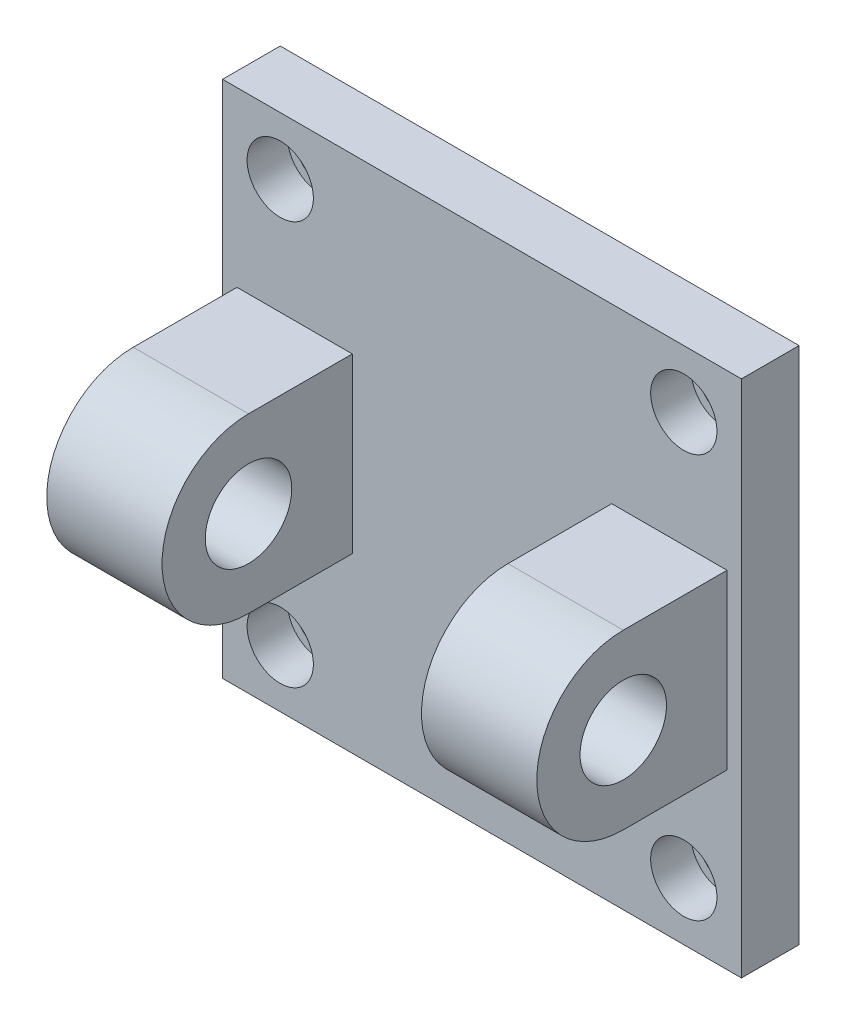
ISO-10303-21;
HEADER;
FILE_DESCRIPTION(('STEP AP214'),'2;1');
FILE_NAME('part.step','',(''),(''),'','','');
FILE_SCHEMA(('AUTOMOTIVE_DESIGN { 1 0 10303 214 1 1 1 1 }'));
ENDSEC;
DATA;
#1=APPLICATION_CONTEXT('core data for automotive mechanical design processes');
#2=APPLICATION_PROTOCOL_DEFINITION('international standard','automotive_design',2000,#1);
#3=PRODUCT_CONTEXT('',#1,'mechanical');
#4=PRODUCT('Part','Part','',(#3));
#5=PRODUCT_RELATED_PRODUCT_CATEGORY('part','',(#4));
#6=PRODUCT_DEFINITION_FORMATION('','',#4);
#7=PRODUCT_DEFINITION_CONTEXT('part definition',#1,'design');
#8=PRODUCT_DEFINITION('design','',#6,#7);
#9=PRODUCT_DEFINITION_SHAPE('','',#8);
#10=(LENGTH_UNIT() NAMED_UNIT(*) SI_UNIT(.MILLI.,.METRE.));
#11=(NAMED_UNIT(*) PLANE_ANGLE_UNIT() SI_UNIT($,.RADIAN.));
#12=(NAMED_UNIT(*) SI_UNIT($,.STERADIAN.) SOLID_ANGLE_UNIT());
#13=UNCERTAINTY_MEASURE_WITH_UNIT(LENGTH_MEASURE(1.E-05),#10,'distance_accuracy_value','');
#14=(GEOMETRIC_REPRESENTATION_CONTEXT(3) GLOBAL_UNCERTAINTY_ASSIGNED_CONTEXT((#13)) GLOBAL_UNIT_ASSIGNED_CONTEXT((#10,
#11,#12)) REPRESENTATION_CONTEXT('',''));
#15=CARTESIAN_POINT('',(0.,0.,0.));
#16=DIRECTION('',(0.,0.,1.));
#17=DIRECTION('',(1.,0.,0.));
#18=AXIS2_PLACEMENT_3D('',#15,#16,#17);
#19=CARTESIAN_POINT('',(70.,-70.,0.));
#20=DIRECTION('',(0.,0.,1.));
#21=DIRECTION('',(1.,0.,0.));
#22=AXIS2_PLACEMENT_3D('',#19,#20,#21);
#23=CYLINDRICAL_SURFACE('',#22,8.50000000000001);
#24=CARTESIAN_POINT('',(70.,-70.,0.));
#25=DIRECTION('',(0.,0.,1.));
#26=DIRECTION('',(1.,0.,0.));
#27=AXIS2_PLACEMENT_3D('',#24,#25,#26);
#28=CIRCLE('',#27,8.50000000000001);
#29=CARTESIAN_POINT('',(78.5,-70.,0.));
#30=VERTEX_POINT('',#29);
#31=EDGE_CURVE('E221',#30,#30,#28,.T.);
#32=ORIENTED_EDGE('',*,*,#31,.F.);
#33=EDGE_LOOP('',(#32));
#34=FACE_BOUND('',#33,.T.);
#35=CARTESIAN_POINT('',(70.,-70.,6.));
#36=DIRECTION('',(0.,0.,1.));
#37=DIRECTION('',(1.,0.,0.));
#38=AXIS2_PLACEMENT_3D('',#35,#36,#37);
#39=CIRCLE('',#38,8.50000000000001);
#40=CARTESIAN_POINT('',(78.5,-70.,6.));
#41=VERTEX_POINT('',#40);
#42=EDGE_CURVE('E41',#41,#41,#39,.F.);
#43=ORIENTED_EDGE('',*,*,#42,.F.);
#44=EDGE_LOOP('',(#43));
#45=FACE_BOUND('',#44,.T.);
#46=ADVANCED_FACE('F37',(#34,#45),#23,.F.);
#47=CARTESIAN_POINT('',(-70.,-70.,0.));
#48=DIRECTION('',(0.,0.,1.));
#49=DIRECTION('',(1.,0.,0.));
#50=AXIS2_PLACEMENT_3D('',#47,#48,#49);
#51=CYLINDRICAL_SURFACE('',#50,8.5);
#52=CARTESIAN_POINT('',(-70.,-70.,0.));
#53=DIRECTION('',(0.,0.,1.));
#54=DIRECTION('',(1.,0.,0.));
#55=AXIS2_PLACEMENT_3D('',#52,#53,#54);
#56=CIRCLE('',#55,8.5);
#57=CARTESIAN_POINT('',(-61.5,-70.,0.));
#58=VERTEX_POINT('',#57);
#59=EDGE_CURVE('E188',#58,#58,#56,.T.);
#60=ORIENTED_EDGE('',*,*,#59,.F.);
#61=EDGE_LOOP('',(#60));
#62=FACE_BOUND('',#61,.T.);
#63=CARTESIAN_POINT('',(-70.,-70.,6.));
#64=DIRECTION('',(0.,0.,1.));
#65=DIRECTION('',(1.,0.,0.));
#66=AXIS2_PLACEMENT_3D('',#63,#64,#65);
#67=CIRCLE('',#66,8.5);
#68=CARTESIAN_POINT('',(-61.5,-70.,6.));
#69=VERTEX_POINT('',#68);
#70=EDGE_CURVE('E194',#69,#69,#67,.F.);
#71=ORIENTED_EDGE('',*,*,#70,.F.);
#72=EDGE_LOOP('',(#71));
#73=FACE_BOUND('',#72,.T.);
#74=ADVANCED_FACE('F304',(#62,#73),#51,.F.);
#75=CARTESIAN_POINT('',(70.,70.,0.));
#76=DIRECTION('',(0.,0.,1.));
#77=DIRECTION('',(1.,0.,0.));
#78=AXIS2_PLACEMENT_3D('',#75,#76,#77);
#79=CYLINDRICAL_SURFACE('',#78,8.49999999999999);
#80=CARTESIAN_POINT('',(70.,70.,0.));
#81=DIRECTION('',(0.,0.,1.));
#82=DIRECTION('',(1.,0.,0.));
#83=AXIS2_PLACEMENT_3D('',#80,#81,#82);
#84=CIRCLE('',#83,8.49999999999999);
#85=CARTESIAN_POINT('',(78.5,70.,0.));
#86=VERTEX_POINT('',#85);
#87=EDGE_CURVE('E224',#86,#86,#84,.T.);
#88=ORIENTED_EDGE('',*,*,#87,.F.);
#89=EDGE_LOOP('',(#88));
#90=FACE_BOUND('',#89,.T.);
#91=CARTESIAN_POINT('',(70.,70.,6.));
#92=DIRECTION('',(0.,0.,1.));
#93=DIRECTION('',(1.,0.,0.));
#94=AXIS2_PLACEMENT_3D('',#91,#92,#93);
#95=CIRCLE('',#94,8.49999999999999);
#96=CARTESIAN_POINT('',(78.5,70.,6.));
#97=VERTEX_POINT('',#96);
#98=EDGE_CURVE('E190',#97,#97,#95,.F.);
#99=ORIENTED_EDGE('',*,*,#98,.F.);
#100=EDGE_LOOP('',(#99));
#101=FACE_BOUND('',#100,.T.);
#102=ADVANCED_FACE('F310',(#90,#101),#79,.F.);
#103=CARTESIAN_POINT('',(-70.,70.,0.));
#104=DIRECTION('',(0.,0.,1.));
#105=DIRECTION('',(1.,0.,0.));
#106=AXIS2_PLACEMENT_3D('',#103,#104,#105);
#107=CYLINDRICAL_SURFACE('',#106,8.5);
#108=CARTESIAN_POINT('',(-70.,70.,0.));
#109=DIRECTION('',(0.,0.,1.));
#110=DIRECTION('',(1.,0.,0.));
#111=AXIS2_PLACEMENT_3D('',#108,#109,#110);
#112=CIRCLE('',#111,8.5);
#113=CARTESIAN_POINT('',(-61.5,70.,0.));
#114=VERTEX_POINT('',#113);
#115=EDGE_CURVE('E227',#114,#114,#112,.T.);
#116=ORIENTED_EDGE('',*,*,#115,.F.);
#117=EDGE_LOOP('',(#116));
#118=FACE_BOUND('',#117,.T.);
#119=CARTESIAN_POINT('',(-70.,70.,6.));
#120=DIRECTION('',(0.,0.,1.));
#121=DIRECTION('',(1.,0.,0.));
#122=AXIS2_PLACEMENT_3D('',#119,#120,#121);
#123=CIRCLE('',#122,8.5);
#124=CARTESIAN_POINT('',(-61.5,70.,6.));
#125=VERTEX_POINT('',#124);
#126=EDGE_CURVE('E185',#125,#125,#123,.F.);
#127=ORIENTED_EDGE('',*,*,#126,.F.);
#128=EDGE_LOOP('',(#127));
#129=FACE_BOUND('',#128,.T.);
#130=ADVANCED_FACE('F319',(#118,#129),#107,.F.);
#131=CARTESIAN_POINT('',(90.,30.,20.));
#132=DIRECTION('',(0.,1.,0.));
#133=DIRECTION('',(-1.,0.,0.));
#134=AXIS2_PLACEMENT_3D('',#131,#132,#133);
#135=PLANE('',#134);
#136=DIRECTION('',(-1.,0.,0.));
#137=VECTOR('',#136,1.);
#138=CARTESIAN_POINT('',(90.,30.,56.));
#139=LINE('',#138,#137);
#140=CARTESIAN_POINT('',(-45.,30.,56.));
#141=VERTEX_POINT('',#140);
#142=CARTESIAN_POINT('',(-85.,30.,56.));
#143=VERTEX_POINT('',#142);
#144=EDGE_CURVE('E269',#141,#143,#139,.T.);
#145=ORIENTED_EDGE('',*,*,#144,.F.);
#146=DIRECTION('',(0.,0.,-1.));
#147=VECTOR('',#146,1.);
#148=CARTESIAN_POINT('',(-45.,30.,20.));
#149=LINE('',#148,#147);
#150=CARTESIAN_POINT('',(-45.,30.,20.));
#151=VERTEX_POINT('',#150);
#152=EDGE_CURVE('E246',#141,#151,#149,.T.);
#153=ORIENTED_EDGE('',*,*,#152,.T.);
#154=DIRECTION('',(-1.,0.,0.));
#155=VECTOR('',#154,1.);
#156=CARTESIAN_POINT('',(90.,30.,20.));
#157=LINE('',#156,#155);
#158=CARTESIAN_POINT('',(-85.,30.,20.));
#159=VERTEX_POINT('',#158);
#160=EDGE_CURVE('E179',#151,#159,#157,.T.);
#161=ORIENTED_EDGE('',*,*,#160,.T.);
#162=DIRECTION('',(0.,0.,1.));
#163=VECTOR('',#162,1.);
#164=CARTESIAN_POINT('',(-85.,30.,20.));
#165=LINE('',#164,#163);
#166=EDGE_CURVE('E164',#159,#143,#165,.T.);
#167=ORIENTED_EDGE('',*,*,#166,.T.);
#168=EDGE_LOOP('',(#145,#153,#161,#167));
#169=FACE_BOUND('',#168,.T.);
#170=ADVANCED_FACE('F283',(#169),#135,.T.);
#171=CARTESIAN_POINT('',(85.,30.,20.));
#172=VERTEX_POINT('',#171);
#173=CARTESIAN_POINT('',(45.,30.,20.));
#174=VERTEX_POINT('',#173);
#175=EDGE_CURVE('E169',#172,#174,#157,.T.);
#176=ORIENTED_EDGE('',*,*,#175,.T.);
#177=DIRECTION('',(0.,0.,1.));
#178=VECTOR('',#177,1.);
#179=CARTESIAN_POINT('',(45.,30.,20.));
#180=LINE('',#179,#178);
#181=CARTESIAN_POINT('',(45.,30.,56.));
#182=VERTEX_POINT('',#181);
#183=EDGE_CURVE('E141',#174,#182,#180,.T.);
#184=ORIENTED_EDGE('',*,*,#183,.T.);
#185=CARTESIAN_POINT('',(85.,30.,56.));
#186=VERTEX_POINT('',#185);
#187=EDGE_CURVE('E266',#186,#182,#139,.T.);
#188=ORIENTED_EDGE('',*,*,#187,.F.);
#189=DIRECTION('',(0.,0.,-1.));
#190=VECTOR('',#189,1.);
#191=CARTESIAN_POINT('',(85.,30.,20.));
#192=LINE('',#191,#190);
#193=EDGE_CURVE('E255',#186,#172,#192,.T.);
#194=ORIENTED_EDGE('',*,*,#193,.T.);
#195=EDGE_LOOP('',(#176,#184,#188,#194));
#196=FACE_BOUND('',#195,.T.);
#197=ADVANCED_FACE('F338',(#196),#135,.T.);
#198=CARTESIAN_POINT('',(90.,0.,56.));
#199=DIRECTION('',(-1.,0.,0.));
#200=DIRECTION('',(0.,-1.,0.));
#201=AXIS2_PLACEMENT_3D('',#198,#199,#200);
#202=CYLINDRICAL_SURFACE('',#201,30.);
#203=DIRECTION('',(-1.,0.,0.));
#204=VECTOR('',#203,1.);
#205=CARTESIAN_POINT('',(90.,-30.,56.));
#206=LINE('',#205,#204);
#207=CARTESIAN_POINT('',(-45.,-30.,56.));
#208=VERTEX_POINT('',#207);
#209=CARTESIAN_POINT('',(-85.,-30.,56.));
#210=VERTEX_POINT('',#209);
#211=EDGE_CURVE('E160',#208,#210,#206,.T.);
#212=ORIENTED_EDGE('',*,*,#211,.F.);
#213=CARTESIAN_POINT('',(-45.,0.,56.));
#214=DIRECTION('',(1.,0.,0.));
#215=DIRECTION('',(0.,1.,0.));
#216=AXIS2_PLACEMENT_3D('',#213,#214,#215);
#217=CIRCLE('',#216,30.);
#218=EDGE_CURVE('E243',#208,#141,#217,.F.);
#219=ORIENTED_EDGE('',*,*,#218,.T.);
#220=ORIENTED_EDGE('',*,*,#144,.T.);
#221=CARTESIAN_POINT('',(-85.,0.,56.));
#222=DIRECTION('',(-1.,0.,0.));
#223=DIRECTION('',(0.,-1.,0.));
#224=AXIS2_PLACEMENT_3D('',#221,#222,#223);
#225=CIRCLE('',#224,30.);
#226=EDGE_CURVE('E261',#143,#210,#225,.F.);
#227=ORIENTED_EDGE('',*,*,#226,.T.);
#228=EDGE_LOOP('',(#212,#219,#220,#227));
#229=FACE_BOUND('',#228,.T.);
#230=ADVANCED_FACE('F276',(#229),#202,.T.);
#231=ORIENTED_EDGE('',*,*,#187,.T.);
#232=CARTESIAN_POINT('',(45.,0.,56.));
#233=DIRECTION('',(-1.,0.,0.));
#234=DIRECTION('',(0.,-1.,0.));
#235=AXIS2_PLACEMENT_3D('',#232,#233,#234);
#236=CIRCLE('',#235,30.);
#237=CARTESIAN_POINT('',(45.,-30.,56.));
#238=VERTEX_POINT('',#237);
#239=EDGE_CURVE('E155',#182,#238,#236,.F.);
#240=ORIENTED_EDGE('',*,*,#239,.T.);
#241=CARTESIAN_POINT('',(85.,-30.,56.));
#242=VERTEX_POINT('',#241);
#243=EDGE_CURVE('E154',#242,#238,#206,.T.);
#244=ORIENTED_EDGE('',*,*,#243,.F.);
#245=CARTESIAN_POINT('',(85.,0.,56.));
#246=DIRECTION('',(1.,0.,0.));
#247=DIRECTION('',(0.,1.,0.));
#248=AXIS2_PLACEMENT_3D('',#245,#246,#247);
#249=CIRCLE('',#248,30.);
#250=EDGE_CURVE('E252',#242,#186,#249,.F.);
#251=ORIENTED_EDGE('',*,*,#250,.T.);
#252=EDGE_LOOP('',(#231,#240,#244,#251));
#253=FACE_BOUND('',#252,.T.);
#254=ADVANCED_FACE('F336',(#253),#202,.T.);
#255=CARTESIAN_POINT('',(90.,-30.,56.));
#256=DIRECTION('',(0.,-1.,0.));
#257=DIRECTION('',(1.,0.,0.));
#258=AXIS2_PLACEMENT_3D('',#255,#256,#257);
#259=PLANE('',#258);
#260=DIRECTION('',(-1.,0.,0.));
#261=VECTOR('',#260,1.);
#262=CARTESIAN_POINT('',(90.,-30.,20.));
#263=LINE('',#262,#261);
#264=CARTESIAN_POINT('',(-45.,-30.,20.));
#265=VERTEX_POINT('',#264);
#266=CARTESIAN_POINT('',(-85.,-30.,20.));
#267=VERTEX_POINT('',#266);
#268=EDGE_CURVE('E161',#265,#267,#263,.T.);
#269=ORIENTED_EDGE('',*,*,#268,.F.);
#270=DIRECTION('',(0.,0.,1.));
#271=VECTOR('',#270,1.);
#272=CARTESIAN_POINT('',(-45.,-30.,56.));
#273=LINE('',#272,#271);
#274=EDGE_CURVE('E240',#265,#208,#273,.T.);
#275=ORIENTED_EDGE('',*,*,#274,.T.);
#276=ORIENTED_EDGE('',*,*,#211,.T.);
#277=DIRECTION('',(0.,0.,-1.));
#278=VECTOR('',#277,1.);
#279=CARTESIAN_POINT('',(-85.,-30.,56.));
#280=LINE('',#279,#278);
#281=EDGE_CURVE('E11',#210,#267,#280,.T.);
#282=ORIENTED_EDGE('',*,*,#281,.T.);
#283=EDGE_LOOP('',(#269,#275,#276,#282));
#284=FACE_BOUND('',#283,.T.);
#285=ADVANCED_FACE('F286',(#284),#259,.T.);
#286=ORIENTED_EDGE('',*,*,#243,.T.);
#287=DIRECTION('',(0.,0.,-1.));
#288=VECTOR('',#287,1.);
#289=CARTESIAN_POINT('',(45.,-30.,56.));
#290=LINE('',#289,#288);
#291=CARTESIAN_POINT('',(45.,-30.,20.));
#292=VERTEX_POINT('',#291);
#293=EDGE_CURVE('E138',#238,#292,#290,.T.);
#294=ORIENTED_EDGE('',*,*,#293,.T.);
#295=CARTESIAN_POINT('',(85.,-30.,20.));
#296=VERTEX_POINT('',#295);
#297=EDGE_CURVE('E152',#296,#292,#263,.T.);
#298=ORIENTED_EDGE('',*,*,#297,.F.);
#299=DIRECTION('',(0.,0.,1.));
#300=VECTOR('',#299,1.);
#301=CARTESIAN_POINT('',(85.,-30.,56.));
#302=LINE('',#301,#300);
#303=EDGE_CURVE('E250',#296,#242,#302,.T.);
#304=ORIENTED_EDGE('',*,*,#303,.T.);
#305=EDGE_LOOP('',(#286,#294,#298,#304));
#306=FACE_BOUND('',#305,.T.);
#307=ADVANCED_FACE('F150',(#306),#259,.T.);
#308=CARTESIAN_POINT('',(-90.,90.,20.));
#309=DIRECTION('',(1.,0.,0.));
#310=DIRECTION('',(0.,1.,0.));
#311=AXIS2_PLACEMENT_3D('',#308,#309,#310);
#312=PLANE('',#311);
#313=DIRECTION('',(0.,0.,-1.));
#314=VECTOR('',#313,1.);
#315=CARTESIAN_POINT('',(-90.,-90.,20.));
#316=LINE('',#315,#314);
#317=CARTESIAN_POINT('',(-90.,-90.,20.));
#318=VERTEX_POINT('',#317);
#319=CARTESIAN_POINT('',(-90.,-90.,0.));
#320=VERTEX_POINT('',#319);
#321=EDGE_CURVE('E46',#318,#320,#316,.T.);
#322=ORIENTED_EDGE('',*,*,#321,.F.);
#323=DIRECTION('',(0.,-1.,0.));
#324=VECTOR('',#323,1.);
#325=CARTESIAN_POINT('',(-90.,90.,20.));
#326=LINE('',#325,#324);
#327=CARTESIAN_POINT('',(-90.,90.,20.));
#328=VERTEX_POINT('',#327);
#329=EDGE_CURVE('E89',#328,#318,#326,.T.);
#330=ORIENTED_EDGE('',*,*,#329,.F.);
#331=DIRECTION('',(0.,0.,-1.));
#332=VECTOR('',#331,1.);
#333=CARTESIAN_POINT('',(-90.,90.,20.));
#334=LINE('',#333,#332);
#335=CARTESIAN_POINT('',(-90.,90.,0.));
#336=VERTEX_POINT('',#335);
#337=EDGE_CURVE('E353',#328,#336,#334,.T.);
#338=ORIENTED_EDGE('',*,*,#337,.T.);
#339=DIRECTION('',(0.,-1.,0.));
#340=VECTOR('',#339,1.);
#341=CARTESIAN_POINT('',(-90.,90.,0.));
#342=LINE('',#341,#340);
#343=EDGE_CURVE('E339',#336,#320,#342,.T.);
#344=ORIENTED_EDGE('',*,*,#343,.T.);
#345=EDGE_LOOP('',(#322,#330,#338,#344));
#346=FACE_BOUND('',#345,.T.);
#347=ADVANCED_FACE('F39',(#346),#312,.F.);
#348=CARTESIAN_POINT('',(90.,-90.,20.));
#349=DIRECTION('',(0.,1.,0.));
#350=DIRECTION('',(-1.,0.,0.));
#351=AXIS2_PLACEMENT_3D('',#348,#349,#350);
#352=PLANE('',#351);
#353=DIRECTION('',(1.,0.,0.));
#354=VECTOR('',#353,1.);
#355=CARTESIAN_POINT('',(90.,-90.,0.));
#356=LINE('',#355,#354);
#357=CARTESIAN_POINT('',(90.,-90.,0.));
#358=VERTEX_POINT('',#357);
#359=EDGE_CURVE('E341',#320,#358,#356,.T.);
#360=ORIENTED_EDGE('',*,*,#359,.T.);
#361=DIRECTION('',(0.,0.,-1.));
#362=VECTOR('',#361,1.);
#363=CARTESIAN_POINT('',(90.,-90.,20.));
#364=LINE('',#363,#362);
#365=CARTESIAN_POINT('',(90.,-90.,20.));
#366=VERTEX_POINT('',#365);
#367=EDGE_CURVE('E357',#366,#358,#364,.T.);
#368=ORIENTED_EDGE('',*,*,#367,.F.);
#369=DIRECTION('',(1.,0.,0.));
#370=VECTOR('',#369,1.);
#371=CARTESIAN_POINT('',(90.,-90.,20.));
#372=LINE('',#371,#370);
#373=EDGE_CURVE('E362',#318,#366,#372,.T.);
#374=ORIENTED_EDGE('',*,*,#373,.F.);
#375=ORIENTED_EDGE('',*,*,#321,.T.);
#376=EDGE_LOOP('',(#360,#368,#374,#375));
#377=FACE_BOUND('',#376,.T.);
#378=ADVANCED_FACE('F369',(#377),#352,.F.);
#379=CARTESIAN_POINT('',(90.,90.,20.));
#380=DIRECTION('',(-1.,0.,0.));
#381=DIRECTION('',(0.,-1.,0.));
#382=AXIS2_PLACEMENT_3D('',#379,#380,#381);
#383=PLANE('',#382);
#384=DIRECTION('',(0.,0.,-1.));
#385=VECTOR('',#384,1.);
#386=CARTESIAN_POINT('',(90.,90.,20.));
#387=LINE('',#386,#385);
#388=CARTESIAN_POINT('',(90.,90.,20.));
#389=VERTEX_POINT('',#388);
#390=CARTESIAN_POINT('',(90.,90.,0.));
#391=VERTEX_POINT('',#390);
#392=EDGE_CURVE('E355',#389,#391,#387,.T.);
#393=ORIENTED_EDGE('',*,*,#392,.F.);
#394=DIRECTION('',(0.,1.,0.));
#395=VECTOR('',#394,1.);
#396=CARTESIAN_POINT('',(90.,90.,20.));
#397=LINE('',#396,#395);
#398=EDGE_CURVE('E363',#366,#389,#397,.T.);
#399=ORIENTED_EDGE('',*,*,#398,.F.);
#400=ORIENTED_EDGE('',*,*,#367,.T.);
#401=DIRECTION('',(0.,1.,0.));
#402=VECTOR('',#401,1.);
#403=CARTESIAN_POINT('',(90.,90.,0.));
#404=LINE('',#403,#402);
#405=EDGE_CURVE('E346',#358,#391,#404,.T.);
#406=ORIENTED_EDGE('',*,*,#405,.T.);
#407=EDGE_LOOP('',(#393,#399,#400,#406));
#408=FACE_BOUND('',#407,.T.);
#409=ADVANCED_FACE('F372',(#408),#383,.F.);
#410=CARTESIAN_POINT('',(90.,90.,20.));
#411=DIRECTION('',(0.,-1.,0.));
#412=DIRECTION('',(1.,0.,0.));
#413=AXIS2_PLACEMENT_3D('',#410,#411,#412);
#414=PLANE('',#413);
#415=DIRECTION('',(-1.,0.,0.));
#416=VECTOR('',#415,1.);
#417=CARTESIAN_POINT('',(90.,90.,0.));
#418=LINE('',#417,#416);
#419=EDGE_CURVE('E84',#391,#336,#418,.T.);
#420=ORIENTED_EDGE('',*,*,#419,.T.);
#421=ORIENTED_EDGE('',*,*,#337,.F.);
#422=DIRECTION('',(-1.,0.,0.));
#423=VECTOR('',#422,1.);
#424=CARTESIAN_POINT('',(90.,90.,20.));
#425=LINE('',#424,#423);
#426=EDGE_CURVE('E63',#389,#328,#425,.T.);
#427=ORIENTED_EDGE('',*,*,#426,.F.);
#428=ORIENTED_EDGE('',*,*,#392,.T.);
#429=EDGE_LOOP('',(#420,#421,#427,#428));
#430=FACE_BOUND('',#429,.T.);
#431=ADVANCED_FACE('F373',(#430),#414,.F.);
#432=CARTESIAN_POINT('',(0.,0.,20.));
#433=DIRECTION('',(0.,0.,-1.));
#434=DIRECTION('',(-1.,0.,0.));
#435=AXIS2_PLACEMENT_3D('',#432,#433,#434);
#436=PLANE('',#435);
#437=CARTESIAN_POINT('',(70.,-70.,20.));
#438=DIRECTION('',(0.,0.,1.));
#439=DIRECTION('',(1.,0.,0.));
#440=AXIS2_PLACEMENT_3D('',#437,#438,#439);
#441=CIRCLE('',#440,11.5);
#442=CARTESIAN_POINT('',(81.5,-70.,20.));
#443=VERTEX_POINT('',#442);
#444=EDGE_CURVE('E210',#443,#443,#441,.T.);
#445=ORIENTED_EDGE('',*,*,#444,.F.);
#446=EDGE_LOOP('',(#445));
#447=FACE_BOUND('',#446,.T.);
#448=CARTESIAN_POINT('',(-70.,-70.,20.));
#449=DIRECTION('',(0.,0.,1.));
#450=DIRECTION('',(1.,0.,0.));
#451=AXIS2_PLACEMENT_3D('',#448,#449,#450);
#452=CIRCLE('',#451,11.5);
#453=CARTESIAN_POINT('',(-58.5,-70.,20.));
#454=VERTEX_POINT('',#453);
#455=EDGE_CURVE('E203',#454,#454,#452,.T.);
#456=ORIENTED_EDGE('',*,*,#455,.F.);
#457=EDGE_LOOP('',(#456));
#458=FACE_BOUND('',#457,.T.);
#459=CARTESIAN_POINT('',(70.,70.,20.));
#460=DIRECTION('',(0.,0.,1.));
#461=DIRECTION('',(1.,0.,0.));
#462=AXIS2_PLACEMENT_3D('',#459,#460,#461);
#463=CIRCLE('',#462,11.5);
#464=CARTESIAN_POINT('',(81.5,70.,20.));
#465=VERTEX_POINT('',#464);
#466=EDGE_CURVE('E196',#465,#465,#463,.T.);
#467=ORIENTED_EDGE('',*,*,#466,.F.);
#468=EDGE_LOOP('',(#467));
#469=FACE_BOUND('',#468,.T.);
#470=CARTESIAN_POINT('',(-70.,70.,20.));
#471=DIRECTION('',(0.,0.,1.));
#472=DIRECTION('',(1.,0.,0.));
#473=AXIS2_PLACEMENT_3D('',#470,#471,#472);
#474=CIRCLE('',#473,11.5);
#475=CARTESIAN_POINT('',(-58.5,70.,20.));
#476=VERTEX_POINT('',#475);
#477=EDGE_CURVE('E192',#476,#476,#474,.T.);
#478=ORIENTED_EDGE('',*,*,#477,.F.);
#479=EDGE_LOOP('',(#478));
#480=FACE_BOUND('',#479,.T.);
#481=ORIENTED_EDGE('',*,*,#160,.F.);
#482=DIRECTION('',(0.,-1.,0.));
#483=VECTOR('',#482,1.);
#484=CARTESIAN_POINT('',(-45.,90.,20.));
#485=LINE('',#484,#483);
#486=EDGE_CURVE('E54',#151,#265,#485,.T.);
#487=ORIENTED_EDGE('',*,*,#486,.T.);
#488=ORIENTED_EDGE('',*,*,#268,.T.);
#489=DIRECTION('',(0.,1.,0.));
#490=VECTOR('',#489,1.);
#491=CARTESIAN_POINT('',(-85.,90.,20.));
#492=LINE('',#491,#490);
#493=EDGE_CURVE('E258',#267,#159,#492,.T.);
#494=ORIENTED_EDGE('',*,*,#493,.T.);
#495=EDGE_LOOP('',(#481,#487,#488,#494));
#496=FACE_BOUND('',#495,.T.);
#497=DIRECTION('',(0.,1.,0.));
#498=VECTOR('',#497,1.);
#499=CARTESIAN_POINT('',(45.,90.,20.));
#500=LINE('',#499,#498);
#501=EDGE_CURVE('E135',#292,#174,#500,.T.);
#502=ORIENTED_EDGE('',*,*,#501,.T.);
#503=ORIENTED_EDGE('',*,*,#175,.F.);
#504=DIRECTION('',(0.,-1.,0.));
#505=VECTOR('',#504,1.);
#506=CARTESIAN_POINT('',(85.,90.,20.));
#507=LINE('',#506,#505);
#508=EDGE_CURVE('E159',#172,#296,#507,.T.);
#509=ORIENTED_EDGE('',*,*,#508,.T.);
#510=ORIENTED_EDGE('',*,*,#297,.T.);
#511=EDGE_LOOP('',(#502,#503,#509,#510));
#512=FACE_BOUND('',#511,.T.);
#513=ORIENTED_EDGE('',*,*,#426,.T.);
#514=ORIENTED_EDGE('',*,*,#329,.T.);
#515=ORIENTED_EDGE('',*,*,#373,.T.);
#516=ORIENTED_EDGE('',*,*,#398,.T.);
#517=EDGE_LOOP('',(#513,#514,#515,#516));
#518=FACE_BOUND('',#517,.T.);
#519=ADVANCED_FACE('F158',(#447,#458,#469,#480,#496,#512,#518),#436,.F.);
#520=CARTESIAN_POINT('',(0.,0.,0.));
#521=DIRECTION('',(0.,0.,-1.));
#522=DIRECTION('',(-1.,0.,0.));
#523=AXIS2_PLACEMENT_3D('',#520,#521,#522);
#524=PLANE('',#523);
#525=ORIENTED_EDGE('',*,*,#59,.T.);
#526=EDGE_LOOP('',(#525));
#527=FACE_BOUND('',#526,.T.);
#528=ORIENTED_EDGE('',*,*,#31,.T.);
#529=EDGE_LOOP('',(#528));
#530=FACE_BOUND('',#529,.T.);
#531=ORIENTED_EDGE('',*,*,#87,.T.);
#532=EDGE_LOOP('',(#531));
#533=FACE_BOUND('',#532,.T.);
#534=ORIENTED_EDGE('',*,*,#115,.T.);
#535=EDGE_LOOP('',(#534));
#536=FACE_BOUND('',#535,.T.);
#537=ORIENTED_EDGE('',*,*,#343,.F.);
#538=ORIENTED_EDGE('',*,*,#419,.F.);
#539=ORIENTED_EDGE('',*,*,#405,.F.);
#540=ORIENTED_EDGE('',*,*,#359,.F.);
#541=EDGE_LOOP('',(#537,#538,#539,#540));
#542=FACE_BOUND('',#541,.T.);
#543=ADVANCED_FACE('F388',(#527,#530,#533,#536,#542),#524,.T.);
#544=CARTESIAN_POINT('',(-85.,90.,90.));
#545=DIRECTION('',(-1.,0.,0.));
#546=DIRECTION('',(0.,-1.,0.));
#547=AXIS2_PLACEMENT_3D('',#544,#545,#546);
#548=PLANE('',#547);
#549=CARTESIAN_POINT('',(-85.,0.,56.));
#550=DIRECTION('',(-1.,0.,0.));
#551=DIRECTION('',(0.,-1.,0.));
#552=AXIS2_PLACEMENT_3D('',#549,#550,#551);
#553=CIRCLE('',#552,15.);
#554=CARTESIAN_POINT('',(-85.,-15.,56.));
#555=VERTEX_POINT('',#554);
#556=EDGE_CURVE('E184',#555,#555,#553,.T.);
#557=ORIENTED_EDGE('',*,*,#556,.F.);
#558=EDGE_LOOP('',(#557));
#559=FACE_BOUND('',#558,.T.);
#560=ORIENTED_EDGE('',*,*,#493,.F.);
#561=ORIENTED_EDGE('',*,*,#281,.F.);
#562=ORIENTED_EDGE('',*,*,#226,.F.);
#563=ORIENTED_EDGE('',*,*,#166,.F.);
#564=EDGE_LOOP('',(#560,#561,#562,#563));
#565=FACE_BOUND('',#564,.T.);
#566=ADVANCED_FACE('F282',(#559,#565),#548,.T.);
#567=CARTESIAN_POINT('',(85.,90.,90.));
#568=DIRECTION('',(1.,0.,0.));
#569=DIRECTION('',(0.,1.,0.));
#570=AXIS2_PLACEMENT_3D('',#567,#568,#569);
#571=PLANE('',#570);
#572=CARTESIAN_POINT('',(85.,0.,56.));
#573=DIRECTION('',(1.,0.,0.));
#574=DIRECTION('',(0.,1.,0.));
#575=AXIS2_PLACEMENT_3D('',#572,#573,#574);
#576=CIRCLE('',#575,15.);
#577=CARTESIAN_POINT('',(85.,15.,56.));
#578=VERTEX_POINT('',#577);
#579=EDGE_CURVE('E234',#578,#578,#576,.T.);
#580=ORIENTED_EDGE('',*,*,#579,.F.);
#581=EDGE_LOOP('',(#580));
#582=FACE_BOUND('',#581,.T.);
#583=ORIENTED_EDGE('',*,*,#250,.F.);
#584=ORIENTED_EDGE('',*,*,#303,.F.);
#585=ORIENTED_EDGE('',*,*,#508,.F.);
#586=ORIENTED_EDGE('',*,*,#193,.F.);
#587=EDGE_LOOP('',(#583,#584,#585,#586));
#588=FACE_BOUND('',#587,.T.);
#589=ADVANCED_FACE('F290',(#582,#588),#571,.T.);
#590=CARTESIAN_POINT('',(-45.,90.,90.));
#591=DIRECTION('',(1.,0.,0.));
#592=DIRECTION('',(0.,1.,0.));
#593=AXIS2_PLACEMENT_3D('',#590,#591,#592);
#594=PLANE('',#593);
#595=CARTESIAN_POINT('',(-45.,0.,56.));
#596=DIRECTION('',(1.,0.,0.));
#597=DIRECTION('',(0.,1.,0.));
#598=AXIS2_PLACEMENT_3D('',#595,#596,#597);
#599=CIRCLE('',#598,15.);
#600=CARTESIAN_POINT('',(-45.,15.,56.));
#601=VERTEX_POINT('',#600);
#602=EDGE_CURVE('E183',#601,#601,#599,.T.);
#603=ORIENTED_EDGE('',*,*,#602,.F.);
#604=EDGE_LOOP('',(#603));
#605=FACE_BOUND('',#604,.T.);
#606=ORIENTED_EDGE('',*,*,#218,.F.);
#607=ORIENTED_EDGE('',*,*,#274,.F.);
#608=ORIENTED_EDGE('',*,*,#486,.F.);
#609=ORIENTED_EDGE('',*,*,#152,.F.);
#610=EDGE_LOOP('',(#606,#607,#608,#609));
#611=FACE_BOUND('',#610,.T.);
#612=ADVANCED_FACE('F288',(#605,#611),#594,.T.);
#613=CARTESIAN_POINT('',(45.,90.,90.));
#614=DIRECTION('',(-1.,0.,0.));
#615=DIRECTION('',(0.,-1.,0.));
#616=AXIS2_PLACEMENT_3D('',#613,#614,#615);
#617=PLANE('',#616);
#618=CARTESIAN_POINT('',(45.,0.,56.));
#619=DIRECTION('',(-1.,0.,0.));
#620=DIRECTION('',(0.,-1.,0.));
#621=AXIS2_PLACEMENT_3D('',#618,#619,#620);
#622=CIRCLE('',#621,15.);
#623=CARTESIAN_POINT('',(45.,-15.,56.));
#624=VERTEX_POINT('',#623);
#625=EDGE_CURVE('E180',#624,#624,#622,.T.);
#626=ORIENTED_EDGE('',*,*,#625,.F.);
#627=EDGE_LOOP('',(#626));
#628=FACE_BOUND('',#627,.T.);
#629=ORIENTED_EDGE('',*,*,#501,.F.);
#630=ORIENTED_EDGE('',*,*,#293,.F.);
#631=ORIENTED_EDGE('',*,*,#239,.F.);
#632=ORIENTED_EDGE('',*,*,#183,.F.);
#633=EDGE_LOOP('',(#629,#630,#631,#632));
#634=FACE_BOUND('',#633,.T.);
#635=ADVANCED_FACE('F137',(#628,#634),#617,.T.);
#636=CARTESIAN_POINT('',(90.,0.,56.));
#637=DIRECTION('',(-1.,0.,0.));
#638=DIRECTION('',(0.,-1.,0.));
#639=AXIS2_PLACEMENT_3D('',#636,#637,#638);
#640=CYLINDRICAL_SURFACE('',#639,15.);
#641=ORIENTED_EDGE('',*,*,#579,.T.);
#642=EDGE_LOOP('',(#641));
#643=FACE_BOUND('',#642,.T.);
#644=ORIENTED_EDGE('',*,*,#625,.T.);
#645=EDGE_LOOP('',(#644));
#646=FACE_BOUND('',#645,.T.);
#647=ADVANCED_FACE('F297',(#643,#646),#640,.F.);
#648=ORIENTED_EDGE('',*,*,#602,.T.);
#649=EDGE_LOOP('',(#648));
#650=FACE_BOUND('',#649,.T.);
#651=ORIENTED_EDGE('',*,*,#556,.T.);
#652=EDGE_LOOP('',(#651));
#653=FACE_BOUND('',#652,.T.);
#654=ADVANCED_FACE('F325',(#650,#653),#640,.F.);
#655=CARTESIAN_POINT('',(-70.,70.,6.));
#656=DIRECTION('',(0.,0.,1.));
#657=DIRECTION('',(1.,0.,0.));
#658=AXIS2_PLACEMENT_3D('',#655,#656,#657);
#659=PLANE('',#658);
#660=CARTESIAN_POINT('',(-70.,70.,6.));
#661=DIRECTION('',(0.,0.,1.));
#662=DIRECTION('',(1.,0.,0.));
#663=AXIS2_PLACEMENT_3D('',#660,#661,#662);
#664=CIRCLE('',#663,11.5);
#665=CARTESIAN_POINT('',(-58.5,70.,6.));
#666=VERTEX_POINT('',#665);
#667=EDGE_CURVE('E189',#666,#666,#664,.T.);
#668=ORIENTED_EDGE('',*,*,#667,.T.);
#669=EDGE_LOOP('',(#668));
#670=FACE_BOUND('',#669,.T.);
#671=ORIENTED_EDGE('',*,*,#126,.T.);
#672=EDGE_LOOP('',(#671));
#673=FACE_BOUND('',#672,.T.);
#674=ADVANCED_FACE('F330',(#670,#673),#659,.T.);
#675=CARTESIAN_POINT('',(-70.,70.,6.));
#676=DIRECTION('',(0.,0.,1.));
#677=DIRECTION('',(1.,0.,0.));
#678=AXIS2_PLACEMENT_3D('',#675,#676,#677);
#679=CYLINDRICAL_SURFACE('',#678,11.5);
#680=ORIENTED_EDGE('',*,*,#667,.F.);
#681=EDGE_LOOP('',(#680));
#682=FACE_BOUND('',#681,.T.);
#683=ORIENTED_EDGE('',*,*,#477,.T.);
#684=EDGE_LOOP('',(#683));
#685=FACE_BOUND('',#684,.T.);
#686=ADVANCED_FACE('F453',(#682,#685),#679,.F.);
#687=CARTESIAN_POINT('',(70.,70.,6.));
#688=DIRECTION('',(0.,0.,1.));
#689=DIRECTION('',(1.,0.,0.));
#690=AXIS2_PLACEMENT_3D('',#687,#688,#689);
#691=PLANE('',#690);
#692=CARTESIAN_POINT('',(70.,70.,6.));
#693=DIRECTION('',(0.,0.,1.));
#694=DIRECTION('',(1.,0.,0.));
#695=AXIS2_PLACEMENT_3D('',#692,#693,#694);
#696=CIRCLE('',#695,11.5);
#697=CARTESIAN_POINT('',(81.5,70.,6.));
#698=VERTEX_POINT('',#697);
#699=EDGE_CURVE('E193',#698,#698,#696,.T.);
#700=ORIENTED_EDGE('',*,*,#699,.T.);
#701=EDGE_LOOP('',(#700));
#702=FACE_BOUND('',#701,.T.);
#703=ORIENTED_EDGE('',*,*,#98,.T.);
#704=EDGE_LOOP('',(#703));
#705=FACE_BOUND('',#704,.T.);
#706=ADVANCED_FACE('F461',(#702,#705),#691,.T.);
#707=CARTESIAN_POINT('',(70.,70.,6.));
#708=DIRECTION('',(0.,0.,1.));
#709=DIRECTION('',(1.,0.,0.));
#710=AXIS2_PLACEMENT_3D('',#707,#708,#709);
#711=CYLINDRICAL_SURFACE('',#710,11.5);
#712=ORIENTED_EDGE('',*,*,#699,.F.);
#713=EDGE_LOOP('',(#712));
#714=FACE_BOUND('',#713,.T.);
#715=ORIENTED_EDGE('',*,*,#466,.T.);
#716=EDGE_LOOP('',(#715));
#717=FACE_BOUND('',#716,.T.);
#718=ADVANCED_FACE('F468',(#714,#717),#711,.F.);
#719=CARTESIAN_POINT('',(-70.,-70.,6.));
#720=DIRECTION('',(0.,0.,1.));
#721=DIRECTION('',(1.,0.,0.));
#722=AXIS2_PLACEMENT_3D('',#719,#720,#721);
#723=PLANE('',#722);
#724=CARTESIAN_POINT('',(-70.,-70.,6.));
#725=DIRECTION('',(0.,0.,1.));
#726=DIRECTION('',(1.,0.,0.));
#727=AXIS2_PLACEMENT_3D('',#724,#725,#726);
#728=CIRCLE('',#727,11.5);
#729=CARTESIAN_POINT('',(-58.5,-70.,6.));
#730=VERTEX_POINT('',#729);
#731=EDGE_CURVE('E197',#730,#730,#728,.T.);
#732=ORIENTED_EDGE('',*,*,#731,.T.);
#733=EDGE_LOOP('',(#732));
#734=FACE_BOUND('',#733,.T.);
#735=ORIENTED_EDGE('',*,*,#70,.T.);
#736=EDGE_LOOP('',(#735));
#737=FACE_BOUND('',#736,.T.);
#738=ADVANCED_FACE('F476',(#734,#737),#723,.T.);
#739=CARTESIAN_POINT('',(-70.,-70.,6.));
#740=DIRECTION('',(0.,0.,1.));
#741=DIRECTION('',(1.,0.,0.));
#742=AXIS2_PLACEMENT_3D('',#739,#740,#741);
#743=CYLINDRICAL_SURFACE('',#742,11.5);
#744=ORIENTED_EDGE('',*,*,#731,.F.);
#745=EDGE_LOOP('',(#744));
#746=FACE_BOUND('',#745,.T.);
#747=ORIENTED_EDGE('',*,*,#455,.T.);
#748=EDGE_LOOP('',(#747));
#749=FACE_BOUND('',#748,.T.);
#750=ADVANCED_FACE('F484',(#746,#749),#743,.F.);
#751=CARTESIAN_POINT('',(70.,-70.,6.));
#752=DIRECTION('',(0.,0.,1.));
#753=DIRECTION('',(1.,0.,0.));
#754=AXIS2_PLACEMENT_3D('',#751,#752,#753);
#755=PLANE('',#754);
#756=CARTESIAN_POINT('',(70.,-70.,6.));
#757=DIRECTION('',(0.,0.,1.));
#758=DIRECTION('',(1.,0.,0.));
#759=AXIS2_PLACEMENT_3D('',#756,#757,#758);
#760=CIRCLE('',#759,11.5);
#761=CARTESIAN_POINT('',(81.5,-70.,6.));
#762=VERTEX_POINT('',#761);
#763=EDGE_CURVE('E614',#762,#762,#760,.T.);
#764=ORIENTED_EDGE('',*,*,#763,.T.);
#765=EDGE_LOOP('',(#764));
#766=FACE_BOUND('',#765,.T.);
#767=ORIENTED_EDGE('',*,*,#42,.T.);
#768=EDGE_LOOP('',(#767));
#769=FACE_BOUND('',#768,.T.);
#770=ADVANCED_FACE('F491',(#766,#769),#755,.T.);
#771=CARTESIAN_POINT('',(70.,-70.,6.));
#772=DIRECTION('',(0.,0.,1.));
#773=DIRECTION('',(1.,0.,0.));
#774=AXIS2_PLACEMENT_3D('',#771,#772,#773);
#775=CYLINDRICAL_SURFACE('',#774,11.5);
#776=ORIENTED_EDGE('',*,*,#763,.F.);
#777=EDGE_LOOP('',(#776));
#778=FACE_BOUND('',#777,.T.);
#779=ORIENTED_EDGE('',*,*,#444,.T.);
#780=EDGE_LOOP('',(#779));
#781=FACE_BOUND('',#780,.T.);
#782=ADVANCED_FACE('F499',(#778,#781),#775,.F.);
#783=CLOSED_SHELL('',(#46,#74,#102,#130,#170,#197,#230,#254,#285,#307,#347,#378,#409,#431,#519,
#543,#566,#589,#612,#635,#647,#654,#674,#686,#706,#718,#738,#750,#770,#782));
#784=MANIFOLD_SOLID_BREP('B2',#783);
#785=ADVANCED_BREP_SHAPE_REPRESENTATION('',(#18,#784),#14);
#786=SHAPE_DEFINITION_REPRESENTATION(#9,#785);
ENDSEC;
END-ISO-10303-21;
